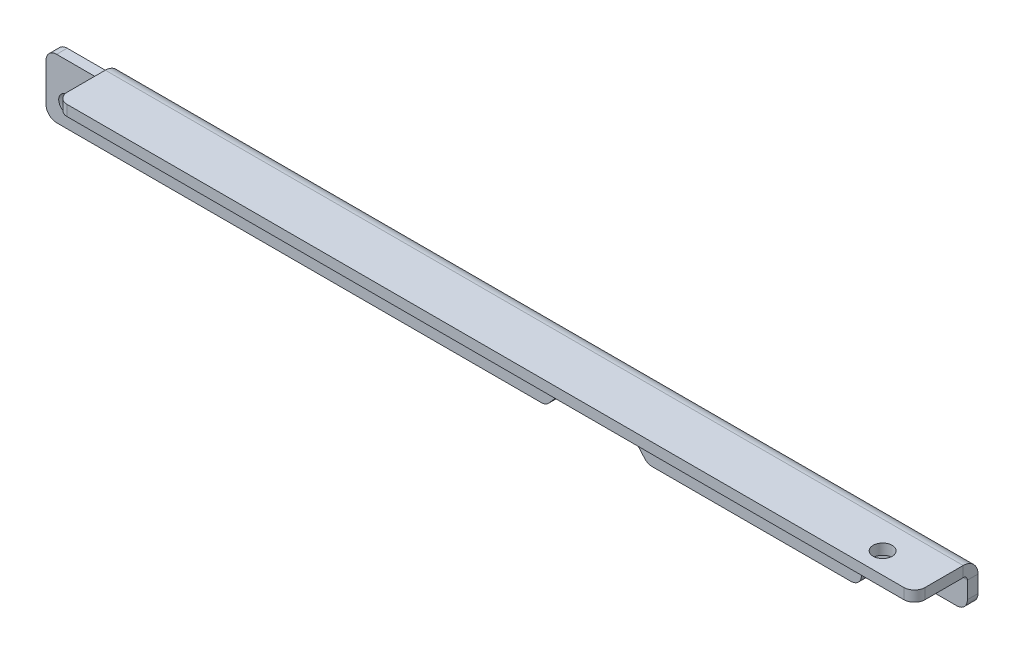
ISO-10303-21;
HEADER;
FILE_DESCRIPTION(('STEP AP214'),'2;1');
FILE_NAME('part.step','',(''),(''),'','','');
FILE_SCHEMA(('AUTOMOTIVE_DESIGN { 1 0 10303 214 1 1 1 1 }'));
ENDSEC;
DATA;
#1=APPLICATION_CONTEXT('core data for automotive mechanical design processes');
#2=APPLICATION_PROTOCOL_DEFINITION('international standard','automotive_design',2000,#1);
#3=PRODUCT_CONTEXT('',#1,'mechanical');
#4=PRODUCT('Part','Part','',(#3));
#5=PRODUCT_RELATED_PRODUCT_CATEGORY('part','',(#4));
#6=PRODUCT_DEFINITION_FORMATION('','',#4);
#7=PRODUCT_DEFINITION_CONTEXT('part definition',#1,'design');
#8=PRODUCT_DEFINITION('design','',#6,#7);
#9=PRODUCT_DEFINITION_SHAPE('','',#8);
#10=(LENGTH_UNIT() NAMED_UNIT(*) SI_UNIT(.MILLI.,.METRE.));
#11=(NAMED_UNIT(*) PLANE_ANGLE_UNIT() SI_UNIT($,.RADIAN.));
#12=(NAMED_UNIT(*) SI_UNIT($,.STERADIAN.) SOLID_ANGLE_UNIT());
#13=UNCERTAINTY_MEASURE_WITH_UNIT(LENGTH_MEASURE(1.E-05),#10,'distance_accuracy_value','');
#14=(GEOMETRIC_REPRESENTATION_CONTEXT(3) GLOBAL_UNCERTAINTY_ASSIGNED_CONTEXT((#13)) GLOBAL_UNIT_ASSIGNED_CONTEXT((#10,
#11,#12)) REPRESENTATION_CONTEXT('',''));
#15=CARTESIAN_POINT('',(0.,0.,0.));
#16=DIRECTION('',(0.,0.,1.));
#17=DIRECTION('',(1.,0.,0.));
#18=AXIS2_PLACEMENT_3D('',#15,#16,#17);
#19=CARTESIAN_POINT('',(-260.,50.,-5.));
#20=DIRECTION('',(-1.,0.,0.));
#21=DIRECTION('',(0.,0.,1.));
#22=AXIS2_PLACEMENT_3D('',#19,#20,#21);
#23=PLANE('',#22);
#24=DIRECTION('',(0.,-1.,0.));
#25=VECTOR('',#24,1.);
#26=CARTESIAN_POINT('',(-260.,50.,0.));
#27=LINE('',#26,#25);
#28=CARTESIAN_POINT('',(-260.,38.,0.));
#29=VERTEX_POINT('',#28);
#30=CARTESIAN_POINT('',(-260.,20.,0.));
#31=VERTEX_POINT('',#30);
#32=EDGE_CURVE('E317',#29,#31,#27,.T.);
#33=ORIENTED_EDGE('',*,*,#32,.F.);
#34=DIRECTION('',(0.,0.,-1.));
#35=VECTOR('',#34,1.);
#36=CARTESIAN_POINT('',(-260.,38.,-5.));
#37=LINE('',#36,#35);
#38=CARTESIAN_POINT('',(-260.,38.,-5.));
#39=VERTEX_POINT('',#38);
#40=EDGE_CURVE('E62',#29,#39,#37,.T.);
#41=ORIENTED_EDGE('',*,*,#40,.T.);
#42=DIRECTION('',(0.,-1.,0.));
#43=VECTOR('',#42,1.);
#44=CARTESIAN_POINT('',(-260.,50.,-5.));
#45=LINE('',#44,#43);
#46=CARTESIAN_POINT('',(-260.,20.,-5.));
#47=VERTEX_POINT('',#46);
#48=EDGE_CURVE('E333',#39,#47,#45,.T.);
#49=ORIENTED_EDGE('',*,*,#48,.T.);
#50=DIRECTION('',(0.,0.,1.));
#51=VECTOR('',#50,1.);
#52=CARTESIAN_POINT('',(-260.,20.,-5.));
#53=LINE('',#52,#51);
#54=EDGE_CURVE('E336',#47,#31,#53,.T.);
#55=ORIENTED_EDGE('',*,*,#54,.T.);
#56=EDGE_LOOP('',(#33,#41,#49,#55));
#57=FACE_BOUND('',#56,.T.);
#58=ADVANCED_FACE('F54',(#57),#23,.T.);
#59=CARTESIAN_POINT('',(-255.,20.,-5.));
#60=DIRECTION('',(0.,0.,1.));
#61=DIRECTION('',(1.,0.,0.));
#62=AXIS2_PLACEMENT_3D('',#59,#60,#61);
#63=PLANE('',#62);
#64=CARTESIAN_POINT('',(22.9809703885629,22.9809703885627,-5.));
#65=DIRECTION('',(0.,0.,1.));
#66=DIRECTION('',(1.,0.,0.));
#67=AXIS2_PLACEMENT_3D('',#64,#65,#66);
#68=CIRCLE('',#67,3.);
#69=CARTESIAN_POINT('',(25.9809703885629,22.9809703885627,-5.));
#70=VERTEX_POINT('',#69);
#71=EDGE_CURVE('E300',#70,#70,#68,.T.);
#72=ORIENTED_EDGE('',*,*,#71,.T.);
#73=EDGE_LOOP('',(#72));
#74=FACE_BOUND('',#73,.T.);
#75=CARTESIAN_POINT('',(-22.9809703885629,22.9809703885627,-5.));
#76=DIRECTION('',(0.,0.,1.));
#77=DIRECTION('',(-1.,0.,0.));
#78=AXIS2_PLACEMENT_3D('',#75,#76,#77);
#79=CIRCLE('',#78,3.);
#80=CARTESIAN_POINT('',(-25.9809703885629,22.9809703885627,-5.));
#81=VERTEX_POINT('',#80);
#82=EDGE_CURVE('E294',#81,#81,#79,.T.);
#83=ORIENTED_EDGE('',*,*,#82,.T.);
#84=EDGE_LOOP('',(#83));
#85=FACE_BOUND('',#84,.T.);
#86=CARTESIAN_POINT('',(-250.,25.,-5.));
#87=DIRECTION('',(0.,0.,1.));
#88=DIRECTION('',(1.,0.,0.));
#89=AXIS2_PLACEMENT_3D('',#86,#87,#88);
#90=CIRCLE('',#89,3.99999999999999);
#91=CARTESIAN_POINT('',(-246.,25.,-5.));
#92=VERTEX_POINT('',#91);
#93=EDGE_CURVE('E288',#92,#92,#90,.T.);
#94=ORIENTED_EDGE('',*,*,#93,.T.);
#95=EDGE_LOOP('',(#94));
#96=FACE_BOUND('',#95,.T.);
#97=DIRECTION('',(0.,1.,0.));
#98=VECTOR('',#97,1.);
#99=CARTESIAN_POINT('',(125.,25.,-5.));
#100=LINE('',#99,#98);
#101=CARTESIAN_POINT('',(125.,20.,-5.));
#102=VERTEX_POINT('',#101);
#103=CARTESIAN_POINT('',(125.,25.,-5.));
#104=VERTEX_POINT('',#103);
#105=EDGE_CURVE('E204',#102,#104,#100,.T.);
#106=ORIENTED_EDGE('',*,*,#105,.F.);
#107=CARTESIAN_POINT('',(120.,20.,-5.));
#108=DIRECTION('',(0.,0.,1.));
#109=DIRECTION('',(1.,0.,0.));
#110=AXIS2_PLACEMENT_3D('',#107,#108,#109);
#111=CIRCLE('',#110,5.);
#112=CARTESIAN_POINT('',(120.,15.,-5.));
#113=VERTEX_POINT('',#112);
#114=EDGE_CURVE('E377',#102,#113,#111,.F.);
#115=ORIENTED_EDGE('',*,*,#114,.T.);
#116=DIRECTION('',(1.,0.,0.));
#117=VECTOR('',#116,1.);
#118=CARTESIAN_POINT('',(23.6431808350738,15.,-5.));
#119=LINE('',#118,#117);
#120=CARTESIAN_POINT('',(26.2488094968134,15.,-5.));
#121=VERTEX_POINT('',#120);
#122=EDGE_CURVE('E328',#121,#113,#119,.T.);
#123=ORIENTED_EDGE('',*,*,#122,.F.);
#124=CARTESIAN_POINT('',(26.2488094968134,20.,-5.));
#125=DIRECTION('',(0.,0.,1.));
#126=DIRECTION('',(1.,0.,0.));
#127=AXIS2_PLACEMENT_3D('',#124,#125,#126);
#128=CIRCLE('',#127,5.);
#129=CARTESIAN_POINT('',(22.2717171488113,16.969696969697,-5.));
#130=VERTEX_POINT('',#129);
#131=EDGE_CURVE('E366',#121,#130,#128,.F.);
#132=ORIENTED_EDGE('',*,*,#131,.T.);
#133=CARTESIAN_POINT('',(0.,0.,-5.));
#134=DIRECTION('',(0.,0.,-1.));
#135=DIRECTION('',(1.,0.,0.));
#136=AXIS2_PLACEMENT_3D('',#133,#134,#135);
#137=CIRCLE('',#136,28.);
#138=CARTESIAN_POINT('',(-22.2717171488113,16.969696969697,-5.));
#139=VERTEX_POINT('',#138);
#140=EDGE_CURVE('E325',#139,#130,#137,.T.);
#141=ORIENTED_EDGE('',*,*,#140,.F.);
#142=CARTESIAN_POINT('',(-26.2488094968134,20.,-5.));
#143=DIRECTION('',(0.,0.,1.));
#144=DIRECTION('',(1.,0.,0.));
#145=AXIS2_PLACEMENT_3D('',#142,#143,#144);
#146=CIRCLE('',#145,5.);
#147=CARTESIAN_POINT('',(-26.2488094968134,15.,-5.));
#148=VERTEX_POINT('',#147);
#149=EDGE_CURVE('E364',#139,#148,#146,.F.);
#150=ORIENTED_EDGE('',*,*,#149,.T.);
#151=DIRECTION('',(1.,0.,0.));
#152=VECTOR('',#151,1.);
#153=CARTESIAN_POINT('',(-23.6431808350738,15.,-5.));
#154=LINE('',#153,#152);
#155=CARTESIAN_POINT('',(-255.,15.,-5.));
#156=VERTEX_POINT('',#155);
#157=EDGE_CURVE('E322',#156,#148,#154,.T.);
#158=ORIENTED_EDGE('',*,*,#157,.F.);
#159=CARTESIAN_POINT('',(-255.,20.,-5.));
#160=DIRECTION('',(0.,0.,1.));
#161=DIRECTION('',(1.,0.,0.));
#162=AXIS2_PLACEMENT_3D('',#159,#160,#161);
#163=CIRCLE('',#162,5.);
#164=EDGE_CURVE('E319',#47,#156,#163,.T.);
#165=ORIENTED_EDGE('',*,*,#164,.F.);
#166=ORIENTED_EDGE('',*,*,#48,.F.);
#167=CARTESIAN_POINT('',(-255.,38.,-5.));
#168=DIRECTION('',(0.,0.,1.));
#169=DIRECTION('',(1.,0.,0.));
#170=AXIS2_PLACEMENT_3D('',#167,#168,#169);
#171=CIRCLE('',#170,5.);
#172=CARTESIAN_POINT('',(-255.,43.,-5.00000000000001));
#173=VERTEX_POINT('',#172);
#174=EDGE_CURVE('E373',#39,#173,#171,.F.);
#175=ORIENTED_EDGE('',*,*,#174,.T.);
#176=DIRECTION('',(-1.,0.,0.));
#177=VECTOR('',#176,1.);
#178=CARTESIAN_POINT('',(-260.,43.,-5.00000000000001));
#179=LINE('',#178,#177);
#180=CARTESIAN_POINT('',(-230.,43.,-5.));
#181=VERTEX_POINT('',#180);
#182=EDGE_CURVE('E277',#173,#181,#179,.F.);
#183=ORIENTED_EDGE('',*,*,#182,.T.);
#184=CARTESIAN_POINT('',(175.,43.,-5.));
#185=VERTEX_POINT('',#184);
#186=EDGE_CURVE('E274',#181,#185,#179,.F.);
#187=ORIENTED_EDGE('',*,*,#186,.T.);
#188=DIRECTION('',(0.,1.,0.));
#189=VECTOR('',#188,1.);
#190=CARTESIAN_POINT('',(175.,50.,-5.));
#191=LINE('',#190,#189);
#192=CARTESIAN_POINT('',(175.,35.,-5.));
#193=VERTEX_POINT('',#192);
#194=EDGE_CURVE('E331',#193,#185,#191,.T.);
#195=ORIENTED_EDGE('',*,*,#194,.F.);
#196=CARTESIAN_POINT('',(170.,35.,-5.));
#197=DIRECTION('',(0.,0.,1.));
#198=DIRECTION('',(1.,0.,0.));
#199=AXIS2_PLACEMENT_3D('',#196,#197,#198);
#200=CIRCLE('',#199,5.);
#201=CARTESIAN_POINT('',(170.,30.,-5.));
#202=VERTEX_POINT('',#201);
#203=EDGE_CURVE('E375',#193,#202,#200,.F.);
#204=ORIENTED_EDGE('',*,*,#203,.T.);
#205=DIRECTION('',(1.,0.,0.));
#206=VECTOR('',#205,1.);
#207=CARTESIAN_POINT('',(175.,30.,-5.));
#208=LINE('',#207,#206);
#209=CARTESIAN_POINT('',(130.,30.,-5.));
#210=VERTEX_POINT('',#209);
#211=EDGE_CURVE('E224',#210,#202,#208,.T.);
#212=ORIENTED_EDGE('',*,*,#211,.F.);
#213=CARTESIAN_POINT('',(130.,25.,-5.));
#214=DIRECTION('',(0.,0.,-1.));
#215=DIRECTION('',(-1.,0.,0.));
#216=AXIS2_PLACEMENT_3D('',#213,#214,#215);
#217=CIRCLE('',#216,5.);
#218=EDGE_CURVE('E214',#104,#210,#217,.T.);
#219=ORIENTED_EDGE('',*,*,#218,.F.);
#220=EDGE_LOOP('',(#106,#115,#123,#132,#141,#150,#158,#165,#166,#175,#183,#187,#195,#204,#212,#219));
#221=FACE_BOUND('',#220,.T.);
#222=ADVANCED_FACE('F226',(#74,#85,#96,#221),#63,.F.);
#223=CARTESIAN_POINT('',(-255.,20.,0.));
#224=DIRECTION('',(0.,0.,1.));
#225=DIRECTION('',(1.,0.,0.));
#226=AXIS2_PLACEMENT_3D('',#223,#224,#225);
#227=PLANE('',#226);
#228=DIRECTION('',(1.,0.,0.));
#229=VECTOR('',#228,1.);
#230=CARTESIAN_POINT('',(23.6431808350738,15.,0.));
#231=LINE('',#230,#229);
#232=CARTESIAN_POINT('',(26.2488094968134,15.,0.));
#233=VERTEX_POINT('',#232);
#234=CARTESIAN_POINT('',(120.,15.,0.));
#235=VERTEX_POINT('',#234);
#236=EDGE_CURVE('E312',#233,#235,#231,.T.);
#237=ORIENTED_EDGE('',*,*,#236,.T.);
#238=CARTESIAN_POINT('',(120.,20.,0.));
#239=DIRECTION('',(0.,0.,1.));
#240=DIRECTION('',(1.,0.,0.));
#241=AXIS2_PLACEMENT_3D('',#238,#239,#240);
#242=CIRCLE('',#241,5.);
#243=CARTESIAN_POINT('',(125.,20.,0.));
#244=VERTEX_POINT('',#243);
#245=EDGE_CURVE('E385',#235,#244,#242,.T.);
#246=ORIENTED_EDGE('',*,*,#245,.T.);
#247=DIRECTION('',(0.,-1.,0.));
#248=VECTOR('',#247,1.);
#249=CARTESIAN_POINT('',(125.,19.9999999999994,0.));
#250=LINE('',#249,#248);
#251=CARTESIAN_POINT('',(125.,25.,0.));
#252=VERTEX_POINT('',#251);
#253=EDGE_CURVE('E231',#252,#244,#250,.T.);
#254=ORIENTED_EDGE('',*,*,#253,.F.);
#255=CARTESIAN_POINT('',(130.,25.,0.));
#256=DIRECTION('',(0.,0.,1.));
#257=DIRECTION('',(1.,0.,0.));
#258=AXIS2_PLACEMENT_3D('',#255,#256,#257);
#259=CIRCLE('',#258,5.);
#260=CARTESIAN_POINT('',(130.,30.,0.));
#261=VERTEX_POINT('',#260);
#262=EDGE_CURVE('E222',#261,#252,#259,.T.);
#263=ORIENTED_EDGE('',*,*,#262,.F.);
#264=DIRECTION('',(-1.,0.,0.));
#265=VECTOR('',#264,1.);
#266=CARTESIAN_POINT('',(-255.,30.,0.));
#267=LINE('',#266,#265);
#268=CARTESIAN_POINT('',(170.,30.,0.));
#269=VERTEX_POINT('',#268);
#270=EDGE_CURVE('E234',#269,#261,#267,.T.);
#271=ORIENTED_EDGE('',*,*,#270,.F.);
#272=CARTESIAN_POINT('',(170.,35.,0.));
#273=DIRECTION('',(0.,0.,1.));
#274=DIRECTION('',(1.,0.,0.));
#275=AXIS2_PLACEMENT_3D('',#272,#273,#274);
#276=CIRCLE('',#275,5.);
#277=CARTESIAN_POINT('',(175.,35.,0.));
#278=VERTEX_POINT('',#277);
#279=EDGE_CURVE('E383',#269,#278,#276,.T.);
#280=ORIENTED_EDGE('',*,*,#279,.T.);
#281=DIRECTION('',(0.,1.,0.));
#282=VECTOR('',#281,1.);
#283=CARTESIAN_POINT('',(175.,50.,0.));
#284=LINE('',#283,#282);
#285=CARTESIAN_POINT('',(175.,43.,0.));
#286=VERTEX_POINT('',#285);
#287=EDGE_CURVE('E315',#278,#286,#284,.T.);
#288=ORIENTED_EDGE('',*,*,#287,.T.);
#289=DIRECTION('',(-1.,0.,0.));
#290=VECTOR('',#289,1.);
#291=CARTESIAN_POINT('',(-260.,43.,0.));
#292=LINE('',#291,#290);
#293=CARTESIAN_POINT('',(-230.,43.,0.));
#294=VERTEX_POINT('',#293);
#295=EDGE_CURVE('E255',#294,#286,#292,.F.);
#296=ORIENTED_EDGE('',*,*,#295,.F.);
#297=CARTESIAN_POINT('',(-255.,43.,0.));
#298=VERTEX_POINT('',#297);
#299=EDGE_CURVE('E275',#298,#294,#292,.F.);
#300=ORIENTED_EDGE('',*,*,#299,.F.);
#301=CARTESIAN_POINT('',(-255.,38.,0.));
#302=DIRECTION('',(0.,0.,1.));
#303=DIRECTION('',(1.,0.,0.));
#304=AXIS2_PLACEMENT_3D('',#301,#302,#303);
#305=CIRCLE('',#304,5.);
#306=EDGE_CURVE('E381',#298,#29,#305,.T.);
#307=ORIENTED_EDGE('',*,*,#306,.T.);
#308=ORIENTED_EDGE('',*,*,#32,.T.);
#309=CARTESIAN_POINT('',(-255.,20.,0.));
#310=DIRECTION('',(0.,0.,1.));
#311=DIRECTION('',(1.,0.,0.));
#312=AXIS2_PLACEMENT_3D('',#309,#310,#311);
#313=CIRCLE('',#312,5.);
#314=CARTESIAN_POINT('',(-255.,15.,0.));
#315=VERTEX_POINT('',#314);
#316=EDGE_CURVE('E303',#31,#315,#313,.T.);
#317=ORIENTED_EDGE('',*,*,#316,.T.);
#318=DIRECTION('',(1.,0.,0.));
#319=VECTOR('',#318,1.);
#320=CARTESIAN_POINT('',(-23.6431808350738,15.,0.));
#321=LINE('',#320,#319);
#322=CARTESIAN_POINT('',(-26.2488094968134,15.,0.));
#323=VERTEX_POINT('',#322);
#324=EDGE_CURVE('E306',#315,#323,#321,.T.);
#325=ORIENTED_EDGE('',*,*,#324,.T.);
#326=CARTESIAN_POINT('',(-26.2488094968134,20.,0.));
#327=DIRECTION('',(0.,0.,1.));
#328=DIRECTION('',(1.,0.,0.));
#329=AXIS2_PLACEMENT_3D('',#326,#327,#328);
#330=CIRCLE('',#329,5.);
#331=CARTESIAN_POINT('',(-22.2717171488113,16.969696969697,0.));
#332=VERTEX_POINT('',#331);
#333=EDGE_CURVE('E358',#323,#332,#330,.T.);
#334=ORIENTED_EDGE('',*,*,#333,.T.);
#335=CARTESIAN_POINT('',(0.,0.,0.));
#336=DIRECTION('',(0.,0.,-1.));
#337=DIRECTION('',(1.,0.,0.));
#338=AXIS2_PLACEMENT_3D('',#335,#336,#337);
#339=CIRCLE('',#338,28.);
#340=CARTESIAN_POINT('',(22.2717171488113,16.969696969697,0.));
#341=VERTEX_POINT('',#340);
#342=EDGE_CURVE('E309',#332,#341,#339,.T.);
#343=ORIENTED_EDGE('',*,*,#342,.T.);
#344=CARTESIAN_POINT('',(26.2488094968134,20.,0.));
#345=DIRECTION('',(0.,0.,1.));
#346=DIRECTION('',(1.,0.,0.));
#347=AXIS2_PLACEMENT_3D('',#344,#345,#346);
#348=CIRCLE('',#347,5.);
#349=EDGE_CURVE('E360',#341,#233,#348,.T.);
#350=ORIENTED_EDGE('',*,*,#349,.T.);
#351=EDGE_LOOP('',(#237,#246,#254,#263,#271,#280,#288,#296,#300,#307,#308,#317,#325,#334,#343,#350));
#352=FACE_BOUND('',#351,.T.);
#353=CARTESIAN_POINT('',(22.9809703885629,22.9809703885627,0.));
#354=DIRECTION('',(0.,0.,1.));
#355=DIRECTION('',(1.,0.,0.));
#356=AXIS2_PLACEMENT_3D('',#353,#354,#355);
#357=CIRCLE('',#356,3.);
#358=CARTESIAN_POINT('',(25.9809703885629,22.9809703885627,0.));
#359=VERTEX_POINT('',#358);
#360=EDGE_CURVE('E297',#359,#359,#357,.T.);
#361=ORIENTED_EDGE('',*,*,#360,.F.);
#362=EDGE_LOOP('',(#361));
#363=FACE_BOUND('',#362,.T.);
#364=CARTESIAN_POINT('',(-22.9809703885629,22.9809703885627,0.));
#365=DIRECTION('',(0.,0.,1.));
#366=DIRECTION('',(-1.,0.,0.));
#367=AXIS2_PLACEMENT_3D('',#364,#365,#366);
#368=CIRCLE('',#367,3.);
#369=CARTESIAN_POINT('',(-25.9809703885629,22.9809703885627,0.));
#370=VERTEX_POINT('',#369);
#371=EDGE_CURVE('E291',#370,#370,#368,.T.);
#372=ORIENTED_EDGE('',*,*,#371,.F.);
#373=EDGE_LOOP('',(#372));
#374=FACE_BOUND('',#373,.T.);
#375=CARTESIAN_POINT('',(-250.,25.,0.));
#376=DIRECTION('',(0.,0.,1.));
#377=DIRECTION('',(1.,0.,0.));
#378=AXIS2_PLACEMENT_3D('',#375,#376,#377);
#379=CIRCLE('',#378,3.99999999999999);
#380=CARTESIAN_POINT('',(-246.,25.,0.));
#381=VERTEX_POINT('',#380);
#382=EDGE_CURVE('E285',#381,#381,#379,.T.);
#383=ORIENTED_EDGE('',*,*,#382,.F.);
#384=EDGE_LOOP('',(#383));
#385=FACE_BOUND('',#384,.T.);
#386=ADVANCED_FACE('F413',(#352,#363,#374,#385),#227,.T.);
#387=CARTESIAN_POINT('',(-255.,20.,-5.));
#388=DIRECTION('',(0.,0.,1.));
#389=DIRECTION('',(1.,0.,0.));
#390=AXIS2_PLACEMENT_3D('',#387,#388,#389);
#391=CYLINDRICAL_SURFACE('',#390,5.);
#392=ORIENTED_EDGE('',*,*,#316,.F.);
#393=ORIENTED_EDGE('',*,*,#54,.F.);
#394=ORIENTED_EDGE('',*,*,#164,.T.);
#395=DIRECTION('',(0.,0.,1.));
#396=VECTOR('',#395,1.);
#397=CARTESIAN_POINT('',(-255.,15.,-5.));
#398=LINE('',#397,#396);
#399=EDGE_CURVE('E335',#156,#315,#398,.T.);
#400=ORIENTED_EDGE('',*,*,#399,.T.);
#401=EDGE_LOOP('',(#392,#393,#394,#400));
#402=FACE_BOUND('',#401,.T.);
#403=ADVANCED_FACE('F56',(#402),#391,.T.);
#404=CARTESIAN_POINT('',(175.,50.,-5.));
#405=DIRECTION('',(1.,0.,0.));
#406=DIRECTION('',(0.,0.,-1.));
#407=AXIS2_PLACEMENT_3D('',#404,#405,#406);
#408=PLANE('',#407);
#409=ORIENTED_EDGE('',*,*,#287,.F.);
#410=DIRECTION('',(0.,0.,-1.));
#411=VECTOR('',#410,1.);
#412=CARTESIAN_POINT('',(175.,35.,-5.));
#413=LINE('',#412,#411);
#414=EDGE_CURVE('E387',#278,#193,#413,.T.);
#415=ORIENTED_EDGE('',*,*,#414,.T.);
#416=ORIENTED_EDGE('',*,*,#194,.T.);
#417=DIRECTION('',(0.,0.,-1.));
#418=VECTOR('',#417,1.);
#419=CARTESIAN_POINT('',(175.,43.,0.));
#420=LINE('',#419,#418);
#421=EDGE_CURVE('E282',#286,#185,#420,.T.);
#422=ORIENTED_EDGE('',*,*,#421,.F.);
#423=EDGE_LOOP('',(#409,#415,#416,#422));
#424=FACE_BOUND('',#423,.T.);
#425=ADVANCED_FACE('F454',(#424),#408,.T.);
#426=CARTESIAN_POINT('',(23.6431808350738,15.,-5.));
#427=DIRECTION('',(0.,-1.,0.));
#428=DIRECTION('',(1.,0.,0.));
#429=AXIS2_PLACEMENT_3D('',#426,#427,#428);
#430=PLANE('',#429);
#431=ORIENTED_EDGE('',*,*,#122,.T.);
#432=DIRECTION('',(0.,0.,-1.));
#433=VECTOR('',#432,1.);
#434=CARTESIAN_POINT('',(120.,15.,0.));
#435=LINE('',#434,#433);
#436=EDGE_CURVE('E379',#113,#235,#435,.F.);
#437=ORIENTED_EDGE('',*,*,#436,.T.);
#438=ORIENTED_EDGE('',*,*,#236,.F.);
#439=DIRECTION('',(0.,0.,1.));
#440=VECTOR('',#439,1.);
#441=CARTESIAN_POINT('',(26.2488094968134,15.,-5.));
#442=LINE('',#441,#440);
#443=EDGE_CURVE('E362',#233,#121,#442,.F.);
#444=ORIENTED_EDGE('',*,*,#443,.T.);
#445=EDGE_LOOP('',(#431,#437,#438,#444));
#446=FACE_BOUND('',#445,.T.);
#447=ADVANCED_FACE('F470',(#446),#430,.T.);
#448=CARTESIAN_POINT('',(0.,0.,-5.));
#449=DIRECTION('',(0.,0.,1.));
#450=DIRECTION('',(1.,0.,0.));
#451=AXIS2_PLACEMENT_3D('',#448,#449,#450);
#452=CYLINDRICAL_SURFACE('',#451,28.);
#453=ORIENTED_EDGE('',*,*,#140,.T.);
#454=DIRECTION('',(0.,0.,1.));
#455=VECTOR('',#454,1.);
#456=CARTESIAN_POINT('',(22.2717171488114,16.969696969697,-5.));
#457=LINE('',#456,#455);
#458=EDGE_CURVE('E355',#130,#341,#457,.T.);
#459=ORIENTED_EDGE('',*,*,#458,.T.);
#460=ORIENTED_EDGE('',*,*,#342,.F.);
#461=DIRECTION('',(0.,0.,1.));
#462=VECTOR('',#461,1.);
#463=CARTESIAN_POINT('',(-22.2717171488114,16.969696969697,-5.));
#464=LINE('',#463,#462);
#465=EDGE_CURVE('E353',#332,#139,#464,.F.);
#466=ORIENTED_EDGE('',*,*,#465,.T.);
#467=EDGE_LOOP('',(#453,#459,#460,#466));
#468=FACE_BOUND('',#467,.T.);
#469=ADVANCED_FACE('F479',(#468),#452,.F.);
#470=CARTESIAN_POINT('',(-23.6431808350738,15.,-5.));
#471=DIRECTION('',(0.,-1.,0.));
#472=DIRECTION('',(1.,0.,0.));
#473=AXIS2_PLACEMENT_3D('',#470,#471,#472);
#474=PLANE('',#473);
#475=ORIENTED_EDGE('',*,*,#157,.T.);
#476=DIRECTION('',(0.,0.,1.));
#477=VECTOR('',#476,1.);
#478=CARTESIAN_POINT('',(-26.2488094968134,15.,-5.));
#479=LINE('',#478,#477);
#480=EDGE_CURVE('E368',#148,#323,#479,.T.);
#481=ORIENTED_EDGE('',*,*,#480,.T.);
#482=ORIENTED_EDGE('',*,*,#324,.F.);
#483=ORIENTED_EDGE('',*,*,#399,.F.);
#484=EDGE_LOOP('',(#475,#481,#482,#483));
#485=FACE_BOUND('',#484,.T.);
#486=ADVANCED_FACE('F486',(#485),#474,.T.);
#487=CARTESIAN_POINT('',(22.9809703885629,22.9809703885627,-5.));
#488=DIRECTION('',(0.,0.,1.));
#489=DIRECTION('',(1.,0.,0.));
#490=AXIS2_PLACEMENT_3D('',#487,#488,#489);
#491=CYLINDRICAL_SURFACE('',#490,3.);
#492=ORIENTED_EDGE('',*,*,#71,.F.);
#493=EDGE_LOOP('',(#492));
#494=FACE_BOUND('',#493,.T.);
#495=ORIENTED_EDGE('',*,*,#360,.T.);
#496=EDGE_LOOP('',(#495));
#497=FACE_BOUND('',#496,.T.);
#498=ADVANCED_FACE('F488',(#494,#497),#491,.F.);
#499=CARTESIAN_POINT('',(-22.9809703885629,22.9809703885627,-5.));
#500=DIRECTION('',(0.,0.,1.));
#501=DIRECTION('',(1.,0.,0.));
#502=AXIS2_PLACEMENT_3D('',#499,#500,#501);
#503=CYLINDRICAL_SURFACE('',#502,3.);
#504=ORIENTED_EDGE('',*,*,#82,.F.);
#505=EDGE_LOOP('',(#504));
#506=FACE_BOUND('',#505,.T.);
#507=ORIENTED_EDGE('',*,*,#371,.T.);
#508=EDGE_LOOP('',(#507));
#509=FACE_BOUND('',#508,.T.);
#510=ADVANCED_FACE('F493',(#506,#509),#503,.F.);
#511=CARTESIAN_POINT('',(-250.,25.,-5.));
#512=DIRECTION('',(0.,0.,1.));
#513=DIRECTION('',(1.,0.,0.));
#514=AXIS2_PLACEMENT_3D('',#511,#512,#513);
#515=CYLINDRICAL_SURFACE('',#514,3.99999999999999);
#516=ORIENTED_EDGE('',*,*,#93,.F.);
#517=EDGE_LOOP('',(#516));
#518=FACE_BOUND('',#517,.T.);
#519=ORIENTED_EDGE('',*,*,#382,.T.);
#520=EDGE_LOOP('',(#519));
#521=FACE_BOUND('',#520,.T.);
#522=ADVANCED_FACE('F618',(#518,#521),#515,.F.);
#523=CARTESIAN_POINT('',(175.,43.,1.99999999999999));
#524=DIRECTION('',(1.,0.,0.));
#525=DIRECTION('',(0.,0.,-1.));
#526=AXIS2_PLACEMENT_3D('',#523,#524,#525);
#527=PLANE('',#526);
#528=DIRECTION('',(0.,-1.,0.));
#529=VECTOR('',#528,1.);
#530=CARTESIAN_POINT('',(175.,50.,1.99999999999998));
#531=LINE('',#530,#529);
#532=CARTESIAN_POINT('',(175.,45.,1.99999999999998));
#533=VERTEX_POINT('',#532);
#534=CARTESIAN_POINT('',(175.,50.,1.99999999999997));
#535=VERTEX_POINT('',#534);
#536=EDGE_CURVE('E268',#533,#535,#531,.F.);
#537=ORIENTED_EDGE('',*,*,#536,.F.);
#538=CARTESIAN_POINT('',(175.,43.,1.99999999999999));
#539=DIRECTION('',(-1.,0.,0.));
#540=DIRECTION('',(0.,0.,1.));
#541=AXIS2_PLACEMENT_3D('',#538,#539,#540);
#542=CIRCLE('',#541,2.);
#543=EDGE_CURVE('E271',#286,#533,#542,.F.);
#544=ORIENTED_EDGE('',*,*,#543,.F.);
#545=ORIENTED_EDGE('',*,*,#421,.T.);
#546=CARTESIAN_POINT('',(175.,43.,1.99999999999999));
#547=DIRECTION('',(-1.,0.,0.));
#548=DIRECTION('',(0.,0.,1.));
#549=AXIS2_PLACEMENT_3D('',#546,#547,#548);
#550=CIRCLE('',#549,7.);
#551=EDGE_CURVE('E279',#185,#535,#550,.F.);
#552=ORIENTED_EDGE('',*,*,#551,.T.);
#553=EDGE_LOOP('',(#537,#544,#545,#552));
#554=FACE_BOUND('',#553,.T.);
#555=ADVANCED_FACE('F440',(#554),#527,.T.);
#556=CARTESIAN_POINT('',(-260.,43.,1.99999999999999));
#557=DIRECTION('',(-1.,0.,0.));
#558=DIRECTION('',(0.,1.,0.));
#559=AXIS2_PLACEMENT_3D('',#556,#557,#558);
#560=CYLINDRICAL_SURFACE('',#559,7.);
#561=CARTESIAN_POINT('',(-230.,43.,1.99999999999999));
#562=DIRECTION('',(1.,0.,0.));
#563=DIRECTION('',(0.,0.,-1.));
#564=AXIS2_PLACEMENT_3D('',#561,#562,#563);
#565=CIRCLE('',#564,7.);
#566=CARTESIAN_POINT('',(-230.,50.,1.99999999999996));
#567=VERTEX_POINT('',#566);
#568=EDGE_CURVE('E246',#567,#181,#565,.F.);
#569=ORIENTED_EDGE('',*,*,#568,.F.);
#570=DIRECTION('',(-1.,0.,0.));
#571=VECTOR('',#570,1.);
#572=CARTESIAN_POINT('',(175.,50.,1.99999999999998));
#573=LINE('',#572,#571);
#574=EDGE_CURVE('E263',#567,#535,#573,.F.);
#575=ORIENTED_EDGE('',*,*,#574,.T.);
#576=ORIENTED_EDGE('',*,*,#551,.F.);
#577=ORIENTED_EDGE('',*,*,#186,.F.);
#578=EDGE_LOOP('',(#569,#575,#576,#577));
#579=FACE_BOUND('',#578,.T.);
#580=ADVANCED_FACE('F429',(#579),#560,.T.);
#581=CARTESIAN_POINT('',(-260.,43.,1.99999999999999));
#582=DIRECTION('',(-1.,0.,0.));
#583=DIRECTION('',(0.,1.,0.));
#584=AXIS2_PLACEMENT_3D('',#581,#582,#583);
#585=CYLINDRICAL_SURFACE('',#584,2.);
#586=DIRECTION('',(-1.,0.,0.));
#587=VECTOR('',#586,1.);
#588=CARTESIAN_POINT('',(175.,45.,1.99999999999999));
#589=LINE('',#588,#587);
#590=CARTESIAN_POINT('',(-230.,45.,1.99999999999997));
#591=VERTEX_POINT('',#590);
#592=EDGE_CURVE('E265',#533,#591,#589,.T.);
#593=ORIENTED_EDGE('',*,*,#592,.T.);
#594=CARTESIAN_POINT('',(-230.,43.,1.99999999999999));
#595=DIRECTION('',(1.,0.,0.));
#596=DIRECTION('',(0.,0.,-1.));
#597=AXIS2_PLACEMENT_3D('',#594,#595,#596);
#598=CIRCLE('',#597,2.);
#599=EDGE_CURVE('E243',#591,#294,#598,.F.);
#600=ORIENTED_EDGE('',*,*,#599,.T.);
#601=ORIENTED_EDGE('',*,*,#295,.T.);
#602=ORIENTED_EDGE('',*,*,#543,.T.);
#603=EDGE_LOOP('',(#593,#600,#601,#602));
#604=FACE_BOUND('',#603,.T.);
#605=ADVANCED_FACE('F450',(#604),#585,.F.);
#606=CARTESIAN_POINT('',(175.,50.,0.));
#607=DIRECTION('',(-1.,0.,0.));
#608=DIRECTION('',(0.,0.,1.));
#609=AXIS2_PLACEMENT_3D('',#606,#607,#608);
#610=PLANE('',#609);
#611=DIRECTION('',(0.,0.,-1.));
#612=VECTOR('',#611,1.);
#613=CARTESIAN_POINT('',(175.,50.,0.));
#614=LINE('',#613,#612);
#615=CARTESIAN_POINT('',(175.,50.0000000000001,20.));
#616=VERTEX_POINT('',#615);
#617=EDGE_CURVE('E256',#616,#535,#614,.T.);
#618=ORIENTED_EDGE('',*,*,#617,.F.);
#619=DIRECTION('',(0.,-1.,0.));
#620=VECTOR('',#619,1.);
#621=CARTESIAN_POINT('',(175.,50.0000000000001,20.));
#622=LINE('',#621,#620);
#623=CARTESIAN_POINT('',(175.,45.0000000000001,20.));
#624=VERTEX_POINT('',#623);
#625=EDGE_CURVE('E339',#616,#624,#622,.T.);
#626=ORIENTED_EDGE('',*,*,#625,.T.);
#627=DIRECTION('',(0.,0.,1.));
#628=VECTOR('',#627,1.);
#629=CARTESIAN_POINT('',(175.,45.,0.));
#630=LINE('',#629,#628);
#631=EDGE_CURVE('E261',#624,#533,#630,.F.);
#632=ORIENTED_EDGE('',*,*,#631,.T.);
#633=ORIENTED_EDGE('',*,*,#536,.T.);
#634=EDGE_LOOP('',(#618,#626,#632,#633));
#635=FACE_BOUND('',#634,.T.);
#636=ADVANCED_FACE('F443',(#635),#610,.F.);
#637=CARTESIAN_POINT('',(175.,50.,0.));
#638=DIRECTION('',(0.,-1.,0.));
#639=DIRECTION('',(0.,0.,-1.));
#640=AXIS2_PLACEMENT_3D('',#637,#638,#639);
#641=PLANE('',#640);
#642=CARTESIAN_POINT('',(150.,50.0000000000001,15.));
#643=DIRECTION('',(0.,1.,0.));
#644=DIRECTION('',(0.,0.,1.));
#645=AXIS2_PLACEMENT_3D('',#642,#643,#644);
#646=CIRCLE('',#645,4.49999999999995);
#647=CARTESIAN_POINT('',(150.,50.0000000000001,19.4999999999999));
#648=VERTEX_POINT('',#647);
#649=EDGE_CURVE('E249',#648,#648,#646,.T.);
#650=ORIENTED_EDGE('',*,*,#649,.F.);
#651=EDGE_LOOP('',(#650));
#652=FACE_BOUND('',#651,.T.);
#653=DIRECTION('',(0.,0.,-1.));
#654=VECTOR('',#653,1.);
#655=CARTESIAN_POINT('',(-230.,50.,25.));
#656=LINE('',#655,#654);
#657=CARTESIAN_POINT('',(-230.,50.,20.));
#658=VERTEX_POINT('',#657);
#659=EDGE_CURVE('E236',#658,#567,#656,.T.);
#660=ORIENTED_EDGE('',*,*,#659,.F.);
#661=CARTESIAN_POINT('',(-225.,50.0000000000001,20.));
#662=DIRECTION('',(0.,-1.,0.));
#663=DIRECTION('',(0.,0.,-1.));
#664=AXIS2_PLACEMENT_3D('',#661,#662,#663);
#665=CIRCLE('',#664,5.);
#666=CARTESIAN_POINT('',(-225.,50.0000000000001,25.));
#667=VERTEX_POINT('',#666);
#668=EDGE_CURVE('E397',#658,#667,#665,.F.);
#669=ORIENTED_EDGE('',*,*,#668,.T.);
#670=DIRECTION('',(1.,0.,0.));
#671=VECTOR('',#670,1.);
#672=CARTESIAN_POINT('',(175.,50.0000000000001,25.));
#673=LINE('',#672,#671);
#674=CARTESIAN_POINT('',(170.,50.0000000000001,25.));
#675=VERTEX_POINT('',#674);
#676=EDGE_CURVE('E253',#667,#675,#673,.T.);
#677=ORIENTED_EDGE('',*,*,#676,.T.);
#678=CARTESIAN_POINT('',(170.,50.0000000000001,20.));
#679=DIRECTION('',(0.,-1.,0.));
#680=DIRECTION('',(0.,0.,-1.));
#681=AXIS2_PLACEMENT_3D('',#678,#679,#680);
#682=CIRCLE('',#681,5.);
#683=EDGE_CURVE('E351',#675,#616,#682,.F.);
#684=ORIENTED_EDGE('',*,*,#683,.T.);
#685=ORIENTED_EDGE('',*,*,#617,.T.);
#686=ORIENTED_EDGE('',*,*,#574,.F.);
#687=EDGE_LOOP('',(#660,#669,#677,#684,#685,#686));
#688=FACE_BOUND('',#687,.T.);
#689=ADVANCED_FACE('F432',(#652,#688),#641,.F.);
#690=CARTESIAN_POINT('',(175.,45.,0.));
#691=DIRECTION('',(0.,-1.,0.));
#692=DIRECTION('',(0.,0.,-1.));
#693=AXIS2_PLACEMENT_3D('',#690,#691,#692);
#694=PLANE('',#693);
#695=DIRECTION('',(-1.,0.,0.));
#696=VECTOR('',#695,1.);
#697=CARTESIAN_POINT('',(175.,45.0000000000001,25.));
#698=LINE('',#697,#696);
#699=CARTESIAN_POINT('',(-225.,45.0000000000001,25.));
#700=VERTEX_POINT('',#699);
#701=CARTESIAN_POINT('',(170.,45.0000000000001,25.));
#702=VERTEX_POINT('',#701);
#703=EDGE_CURVE('E259',#700,#702,#698,.F.);
#704=ORIENTED_EDGE('',*,*,#703,.F.);
#705=CARTESIAN_POINT('',(-225.,45.0000000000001,20.));
#706=DIRECTION('',(0.,-1.,0.));
#707=DIRECTION('',(0.,0.,-1.));
#708=AXIS2_PLACEMENT_3D('',#705,#706,#707);
#709=CIRCLE('',#708,5.);
#710=CARTESIAN_POINT('',(-230.,45.0000000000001,20.));
#711=VERTEX_POINT('',#710);
#712=EDGE_CURVE('E77',#700,#711,#709,.T.);
#713=ORIENTED_EDGE('',*,*,#712,.T.);
#714=DIRECTION('',(0.,0.,1.));
#715=VECTOR('',#714,1.);
#716=CARTESIAN_POINT('',(-230.,45.,0.));
#717=LINE('',#716,#715);
#718=EDGE_CURVE('E240',#591,#711,#717,.T.);
#719=ORIENTED_EDGE('',*,*,#718,.F.);
#720=ORIENTED_EDGE('',*,*,#592,.F.);
#721=ORIENTED_EDGE('',*,*,#631,.F.);
#722=CARTESIAN_POINT('',(170.,45.0000000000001,20.));
#723=DIRECTION('',(0.,-1.,0.));
#724=DIRECTION('',(0.,0.,-1.));
#725=AXIS2_PLACEMENT_3D('',#722,#723,#724);
#726=CIRCLE('',#725,5.);
#727=EDGE_CURVE('E345',#624,#702,#726,.T.);
#728=ORIENTED_EDGE('',*,*,#727,.T.);
#729=EDGE_LOOP('',(#704,#713,#719,#720,#721,#728));
#730=FACE_BOUND('',#729,.T.);
#731=CARTESIAN_POINT('',(150.,45.0000000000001,15.));
#732=DIRECTION('',(0.,-1.,0.));
#733=DIRECTION('',(0.,0.,-1.));
#734=AXIS2_PLACEMENT_3D('',#731,#732,#733);
#735=CIRCLE('',#734,4.49999999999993);
#736=CARTESIAN_POINT('',(150.,45.,10.5000000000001));
#737=VERTEX_POINT('',#736);
#738=EDGE_CURVE('E252',#737,#737,#735,.T.);
#739=ORIENTED_EDGE('',*,*,#738,.F.);
#740=EDGE_LOOP('',(#739));
#741=FACE_BOUND('',#740,.T.);
#742=ADVANCED_FACE('F446',(#730,#741),#694,.T.);
#743=CARTESIAN_POINT('',(175.,50.0000000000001,25.));
#744=DIRECTION('',(0.,0.,-1.));
#745=DIRECTION('',(0.,1.,0.));
#746=AXIS2_PLACEMENT_3D('',#743,#744,#745);
#747=PLANE('',#746);
#748=ORIENTED_EDGE('',*,*,#676,.F.);
#749=DIRECTION('',(0.,-1.,0.));
#750=VECTOR('',#749,1.);
#751=CARTESIAN_POINT('',(-225.,50.0000000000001,25.));
#752=LINE('',#751,#750);
#753=EDGE_CURVE('E392',#667,#700,#752,.T.);
#754=ORIENTED_EDGE('',*,*,#753,.T.);
#755=ORIENTED_EDGE('',*,*,#703,.T.);
#756=DIRECTION('',(0.,-1.,0.));
#757=VECTOR('',#756,1.);
#758=CARTESIAN_POINT('',(170.,50.0000000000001,25.));
#759=LINE('',#758,#757);
#760=EDGE_CURVE('E348',#702,#675,#759,.F.);
#761=ORIENTED_EDGE('',*,*,#760,.T.);
#762=EDGE_LOOP('',(#748,#754,#755,#761));
#763=FACE_BOUND('',#762,.T.);
#764=ADVANCED_FACE('F671',(#763),#747,.F.);
#765=CARTESIAN_POINT('',(150.,50.0000000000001,15.));
#766=DIRECTION('',(0.,1.,0.));
#767=DIRECTION('',(0.,0.,1.));
#768=AXIS2_PLACEMENT_3D('',#765,#766,#767);
#769=CYLINDRICAL_SURFACE('',#768,4.49999999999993);
#770=ORIENTED_EDGE('',*,*,#738,.T.);
#771=EDGE_LOOP('',(#770));
#772=FACE_BOUND('',#771,.T.);
#773=ORIENTED_EDGE('',*,*,#649,.T.);
#774=EDGE_LOOP('',(#773));
#775=FACE_BOUND('',#774,.T.);
#776=ADVANCED_FACE('F680',(#772,#775),#769,.F.);
#777=CARTESIAN_POINT('',(170.,50.0000000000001,20.));
#778=DIRECTION('',(0.,-1.,0.));
#779=DIRECTION('',(0.,0.,-1.));
#780=AXIS2_PLACEMENT_3D('',#777,#778,#779);
#781=CYLINDRICAL_SURFACE('',#780,5.);
#782=ORIENTED_EDGE('',*,*,#683,.F.);
#783=ORIENTED_EDGE('',*,*,#760,.F.);
#784=ORIENTED_EDGE('',*,*,#727,.F.);
#785=ORIENTED_EDGE('',*,*,#625,.F.);
#786=EDGE_LOOP('',(#782,#783,#784,#785));
#787=FACE_BOUND('',#786,.T.);
#788=ADVANCED_FACE('F525',(#787),#781,.T.);
#789=CARTESIAN_POINT('',(26.2488094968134,20.,-5.));
#790=DIRECTION('',(0.,0.,1.));
#791=DIRECTION('',(1.,0.,0.));
#792=AXIS2_PLACEMENT_3D('',#789,#790,#791);
#793=CYLINDRICAL_SURFACE('',#792,5.);
#794=ORIENTED_EDGE('',*,*,#131,.F.);
#795=ORIENTED_EDGE('',*,*,#443,.F.);
#796=ORIENTED_EDGE('',*,*,#349,.F.);
#797=ORIENTED_EDGE('',*,*,#458,.F.);
#798=EDGE_LOOP('',(#794,#795,#796,#797));
#799=FACE_BOUND('',#798,.T.);
#800=ADVANCED_FACE('F474',(#799),#793,.T.);
#801=CARTESIAN_POINT('',(-26.2488094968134,20.,-5.));
#802=DIRECTION('',(0.,0.,1.));
#803=DIRECTION('',(1.,0.,0.));
#804=AXIS2_PLACEMENT_3D('',#801,#802,#803);
#805=CYLINDRICAL_SURFACE('',#804,5.);
#806=ORIENTED_EDGE('',*,*,#149,.F.);
#807=ORIENTED_EDGE('',*,*,#465,.F.);
#808=ORIENTED_EDGE('',*,*,#333,.F.);
#809=ORIENTED_EDGE('',*,*,#480,.F.);
#810=EDGE_LOOP('',(#806,#807,#808,#809));
#811=FACE_BOUND('',#810,.T.);
#812=ADVANCED_FACE('F483',(#811),#805,.T.);
#813=CARTESIAN_POINT('',(-260.,43.,25.));
#814=DIRECTION('',(0.,-1.,0.));
#815=DIRECTION('',(1.,0.,0.));
#816=AXIS2_PLACEMENT_3D('',#813,#814,#815);
#817=PLANE('',#816);
#818=ORIENTED_EDGE('',*,*,#182,.F.);
#819=DIRECTION('',(0.,0.,-1.));
#820=VECTOR('',#819,1.);
#821=CARTESIAN_POINT('',(-255.,43.,0.));
#822=LINE('',#821,#820);
#823=EDGE_CURVE('E13',#173,#298,#822,.F.);
#824=ORIENTED_EDGE('',*,*,#823,.T.);
#825=ORIENTED_EDGE('',*,*,#299,.T.);
#826=DIRECTION('',(0.,0.,-1.));
#827=VECTOR('',#826,1.);
#828=CARTESIAN_POINT('',(-230.,43.,25.));
#829=LINE('',#828,#827);
#830=EDGE_CURVE('E237',#294,#181,#829,.T.);
#831=ORIENTED_EDGE('',*,*,#830,.T.);
#832=EDGE_LOOP('',(#818,#824,#825,#831));
#833=FACE_BOUND('',#832,.T.);
#834=ADVANCED_FACE('F420',(#833),#817,.F.);
#835=CARTESIAN_POINT('',(-230.,43.,25.));
#836=DIRECTION('',(1.,0.,0.));
#837=DIRECTION('',(0.,0.,-1.));
#838=AXIS2_PLACEMENT_3D('',#835,#836,#837);
#839=PLANE('',#838);
#840=ORIENTED_EDGE('',*,*,#718,.T.);
#841=DIRECTION('',(0.,-1.,0.));
#842=VECTOR('',#841,1.);
#843=CARTESIAN_POINT('',(-230.,43.,20.));
#844=LINE('',#843,#842);
#845=EDGE_CURVE('E69',#711,#658,#844,.F.);
#846=ORIENTED_EDGE('',*,*,#845,.T.);
#847=ORIENTED_EDGE('',*,*,#659,.T.);
#848=ORIENTED_EDGE('',*,*,#568,.T.);
#849=ORIENTED_EDGE('',*,*,#830,.F.);
#850=ORIENTED_EDGE('',*,*,#599,.F.);
#851=EDGE_LOOP('',(#840,#846,#847,#848,#849,#850));
#852=FACE_BOUND('',#851,.T.);
#853=ADVANCED_FACE('F426',(#852),#839,.F.);
#854=CARTESIAN_POINT('',(175.,30.,25.));
#855=DIRECTION('',(0.,1.,0.));
#856=DIRECTION('',(0.,0.,1.));
#857=AXIS2_PLACEMENT_3D('',#854,#855,#856);
#858=PLANE('',#857);
#859=ORIENTED_EDGE('',*,*,#211,.T.);
#860=DIRECTION('',(0.,0.,-1.));
#861=VECTOR('',#860,1.);
#862=CARTESIAN_POINT('',(170.,30.,0.));
#863=LINE('',#862,#861);
#864=EDGE_CURVE('E390',#202,#269,#863,.F.);
#865=ORIENTED_EDGE('',*,*,#864,.T.);
#866=ORIENTED_EDGE('',*,*,#270,.T.);
#867=DIRECTION('',(0.,0.,-1.));
#868=VECTOR('',#867,1.);
#869=CARTESIAN_POINT('',(130.,30.,25.));
#870=LINE('',#869,#868);
#871=EDGE_CURVE('E223',#261,#210,#870,.T.);
#872=ORIENTED_EDGE('',*,*,#871,.T.);
#873=EDGE_LOOP('',(#859,#865,#866,#872));
#874=FACE_BOUND('',#873,.T.);
#875=ADVANCED_FACE('F459',(#874),#858,.F.);
#876=CARTESIAN_POINT('',(130.,25.,25.));
#877=DIRECTION('',(0.,0.,-1.));
#878=DIRECTION('',(-1.,0.,0.));
#879=AXIS2_PLACEMENT_3D('',#876,#877,#878);
#880=CYLINDRICAL_SURFACE('',#879,5.);
#881=ORIENTED_EDGE('',*,*,#262,.T.);
#882=DIRECTION('',(0.,0.,-1.));
#883=VECTOR('',#882,1.);
#884=CARTESIAN_POINT('',(125.,25.,25.));
#885=LINE('',#884,#883);
#886=EDGE_CURVE('E208',#252,#104,#885,.T.);
#887=ORIENTED_EDGE('',*,*,#886,.T.);
#888=ORIENTED_EDGE('',*,*,#218,.T.);
#889=ORIENTED_EDGE('',*,*,#871,.F.);
#890=EDGE_LOOP('',(#881,#887,#888,#889));
#891=FACE_BOUND('',#890,.T.);
#892=ADVANCED_FACE('F218',(#891),#880,.F.);
#893=CARTESIAN_POINT('',(125.,25.,25.));
#894=DIRECTION('',(-1.,0.,0.));
#895=DIRECTION('',(0.,-1.,0.));
#896=AXIS2_PLACEMENT_3D('',#893,#894,#895);
#897=PLANE('',#896);
#898=ORIENTED_EDGE('',*,*,#253,.T.);
#899=DIRECTION('',(0.,0.,-1.));
#900=VECTOR('',#899,1.);
#901=CARTESIAN_POINT('',(125.,20.,-5.));
#902=LINE('',#901,#900);
#903=EDGE_CURVE('E211',#244,#102,#902,.T.);
#904=ORIENTED_EDGE('',*,*,#903,.T.);
#905=ORIENTED_EDGE('',*,*,#105,.T.);
#906=ORIENTED_EDGE('',*,*,#886,.F.);
#907=EDGE_LOOP('',(#898,#904,#905,#906));
#908=FACE_BOUND('',#907,.T.);
#909=ADVANCED_FACE('F207',(#908),#897,.F.);
#910=CARTESIAN_POINT('',(120.,20.,25.));
#911=DIRECTION('',(0.,0.,1.));
#912=DIRECTION('',(1.,0.,0.));
#913=AXIS2_PLACEMENT_3D('',#910,#911,#912);
#914=CYLINDRICAL_SURFACE('',#913,5.);
#915=ORIENTED_EDGE('',*,*,#245,.F.);
#916=ORIENTED_EDGE('',*,*,#436,.F.);
#917=ORIENTED_EDGE('',*,*,#114,.F.);
#918=ORIENTED_EDGE('',*,*,#903,.F.);
#919=EDGE_LOOP('',(#915,#916,#917,#918));
#920=FACE_BOUND('',#919,.T.);
#921=ADVANCED_FACE('F465',(#920),#914,.T.);
#922=CARTESIAN_POINT('',(170.,35.,-5.));
#923=DIRECTION('',(0.,0.,1.));
#924=DIRECTION('',(1.,0.,0.));
#925=AXIS2_PLACEMENT_3D('',#922,#923,#924);
#926=CYLINDRICAL_SURFACE('',#925,5.);
#927=ORIENTED_EDGE('',*,*,#279,.F.);
#928=ORIENTED_EDGE('',*,*,#864,.F.);
#929=ORIENTED_EDGE('',*,*,#203,.F.);
#930=ORIENTED_EDGE('',*,*,#414,.F.);
#931=EDGE_LOOP('',(#927,#928,#929,#930));
#932=FACE_BOUND('',#931,.T.);
#933=ADVANCED_FACE('F462',(#932),#926,.T.);
#934=CARTESIAN_POINT('',(-225.,50.0000000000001,20.));
#935=DIRECTION('',(0.,-1.,0.));
#936=DIRECTION('',(0.,0.,-1.));
#937=AXIS2_PLACEMENT_3D('',#934,#935,#936);
#938=CYLINDRICAL_SURFACE('',#937,5.);
#939=ORIENTED_EDGE('',*,*,#668,.F.);
#940=ORIENTED_EDGE('',*,*,#845,.F.);
#941=ORIENTED_EDGE('',*,*,#712,.F.);
#942=ORIENTED_EDGE('',*,*,#753,.F.);
#943=EDGE_LOOP('',(#939,#940,#941,#942));
#944=FACE_BOUND('',#943,.T.);
#945=ADVANCED_FACE('F727',(#944),#938,.T.);
#946=CARTESIAN_POINT('',(-255.,38.,-5.));
#947=DIRECTION('',(0.,0.,1.));
#948=DIRECTION('',(1.,0.,0.));
#949=AXIS2_PLACEMENT_3D('',#946,#947,#948);
#950=CYLINDRICAL_SURFACE('',#949,5.);
#951=ORIENTED_EDGE('',*,*,#306,.F.);
#952=ORIENTED_EDGE('',*,*,#823,.F.);
#953=ORIENTED_EDGE('',*,*,#174,.F.);
#954=ORIENTED_EDGE('',*,*,#40,.F.);
#955=EDGE_LOOP('',(#951,#952,#953,#954));
#956=FACE_BOUND('',#955,.T.);
#957=ADVANCED_FACE('F418',(#956),#950,.T.);
#958=CLOSED_SHELL('',(#58,#222,#386,#403,#425,#447,#469,#486,#498,#510,#522,#555,#580,#605,#636,
#689,#742,#764,#776,#788,#800,#812,#834,#853,#875,#892,#909,#921,#933,#945,#957));
#959=MANIFOLD_SOLID_BREP('B2',#958);
#960=ADVANCED_BREP_SHAPE_REPRESENTATION('',(#18,#959),#14);
#961=SHAPE_DEFINITION_REPRESENTATION(#9,#960);
ENDSEC;
END-ISO-10303-21;
